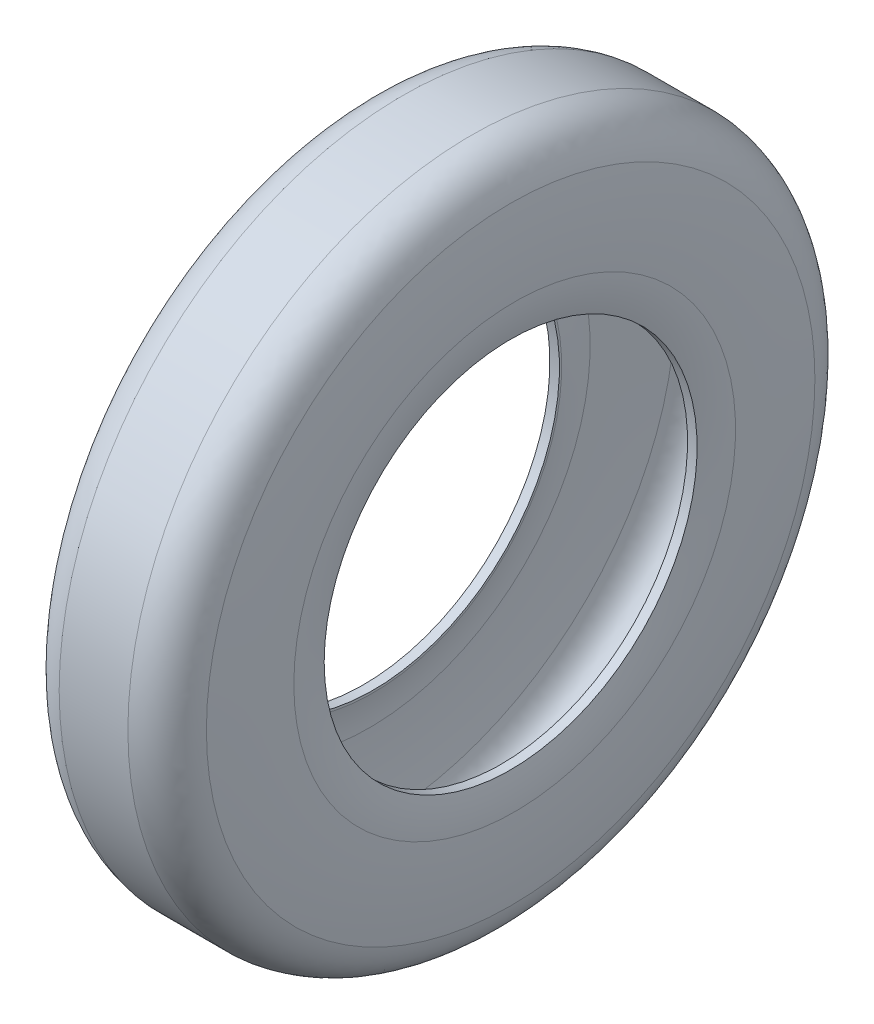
ISO-10303-21;
HEADER;
FILE_DESCRIPTION(('STEP AP214'),'2;1');
FILE_NAME('part.step','',(''),(''),'','','');
FILE_SCHEMA(('AUTOMOTIVE_DESIGN { 1 0 10303 214 1 1 1 1 }'));
ENDSEC;
DATA;
#1=APPLICATION_CONTEXT('core data for automotive mechanical design processes');
#2=APPLICATION_PROTOCOL_DEFINITION('international standard','automotive_design',2000,#1);
#3=PRODUCT_CONTEXT('',#1,'mechanical');
#4=PRODUCT('Part','Part','',(#3));
#5=PRODUCT_RELATED_PRODUCT_CATEGORY('part','',(#4));
#6=PRODUCT_DEFINITION_FORMATION('','',#4);
#7=PRODUCT_DEFINITION_CONTEXT('part definition',#1,'design');
#8=PRODUCT_DEFINITION('design','',#6,#7);
#9=PRODUCT_DEFINITION_SHAPE('','',#8);
#10=(LENGTH_UNIT() NAMED_UNIT(*) SI_UNIT(.MILLI.,.METRE.));
#11=(NAMED_UNIT(*) PLANE_ANGLE_UNIT() SI_UNIT($,.RADIAN.));
#12=(NAMED_UNIT(*) SI_UNIT($,.STERADIAN.) SOLID_ANGLE_UNIT());
#13=UNCERTAINTY_MEASURE_WITH_UNIT(LENGTH_MEASURE(1.E-05),#10,'distance_accuracy_value','');
#14=(GEOMETRIC_REPRESENTATION_CONTEXT(3) GLOBAL_UNCERTAINTY_ASSIGNED_CONTEXT((#13)) GLOBAL_UNIT_ASSIGNED_CONTEXT((#10,
#11,#12)) REPRESENTATION_CONTEXT('',''));
#15=CARTESIAN_POINT('',(0.,0.,0.));
#16=DIRECTION('',(0.,0.,1.));
#17=DIRECTION('',(1.,0.,0.));
#18=AXIS2_PLACEMENT_3D('',#15,#16,#17);
#19=CARTESIAN_POINT('',(-39.5580046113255,112.515379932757,0.));
#20=CARTESIAN_POINT('',(-39.553838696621,103.632489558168,0.));
#21=CARTESIAN_POINT('',(-37.5,95.,0.));
#22=B_SPLINE_CURVE_WITH_KNOTS('',2,(#19,#20,#21),.UNSPECIFIED.,.F.,.F.,(3,3),(0.,1.),.UNSPECIFIED.);
#23=CARTESIAN_POINT('',(-171.693896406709,0.,0.));
#24=DIRECTION('',(-1.,0.,0.));
#25=AXIS1_PLACEMENT('',#23,#24);
#26=SURFACE_OF_REVOLUTION('',#22,#25);
#27=CARTESIAN_POINT('',(-37.5,0.,0.));
#28=DIRECTION('',(-1.,0.,0.));
#29=DIRECTION('',(0.,0.,1.));
#30=AXIS2_PLACEMENT_3D('',#27,#28,#29);
#31=CIRCLE('',#30,95.);
#32=CARTESIAN_POINT('',(-37.5,0.,95.));
#33=VERTEX_POINT('',#32);
#34=EDGE_CURVE('E10',#33,#33,#31,.T.);
#35=ORIENTED_EDGE('',*,*,#34,.F.);
#36=EDGE_LOOP('',(#35));
#37=FACE_BOUND('',#36,.T.);
#38=CARTESIAN_POINT('',(-39.5580046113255,0.,0.));
#39=DIRECTION('',(-1.,0.,0.));
#40=DIRECTION('',(0.,0.,1.));
#41=AXIS2_PLACEMENT_3D('',#38,#39,#40);
#42=CIRCLE('',#41,112.515379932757);
#43=CARTESIAN_POINT('',(-39.5580046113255,0.,112.515379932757));
#44=VERTEX_POINT('',#43);
#45=EDGE_CURVE('E94',#44,#44,#42,.T.);
#46=ORIENTED_EDGE('',*,*,#45,.T.);
#47=EDGE_LOOP('',(#46));
#48=FACE_BOUND('',#47,.T.);
#49=ADVANCED_FACE('F35',(#37,#48),#26,.T.);
#50=CARTESIAN_POINT('',(-171.693896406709,0.,0.));
#51=DIRECTION('',(-1.,0.,0.));
#52=DIRECTION('',(0.,0.,1.));
#53=AXIS2_PLACEMENT_3D('',#50,#51,#52);
#54=CYLINDRICAL_SURFACE('',#53,95.);
#55=CARTESIAN_POINT('',(-32.635776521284,0.,0.));
#56=DIRECTION('',(-1.,0.,0.));
#57=DIRECTION('',(0.,0.,1.));
#58=AXIS2_PLACEMENT_3D('',#55,#56,#57);
#59=CIRCLE('',#58,95.);
#60=CARTESIAN_POINT('',(-32.635776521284,0.,95.));
#61=VERTEX_POINT('',#60);
#62=EDGE_CURVE('E42',#61,#61,#59,.T.);
#63=ORIENTED_EDGE('',*,*,#62,.F.);
#64=EDGE_LOOP('',(#63));
#65=FACE_BOUND('',#64,.T.);
#66=ORIENTED_EDGE('',*,*,#34,.T.);
#67=EDGE_LOOP('',(#66));
#68=FACE_BOUND('',#67,.T.);
#69=ADVANCED_FACE('F227',(#65,#68),#54,.F.);
#70=CARTESIAN_POINT('',(-32.635776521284,95.,0.));
#71=DIRECTION('',(-1.,0.,0.));
#72=DIRECTION('',(0.,0.,1.));
#73=AXIS2_PLACEMENT_3D('',#70,#71,#72);
#74=PLANE('',#73);
#75=CARTESIAN_POINT('',(-32.635776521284,0.,0.));
#76=DIRECTION('',(-1.,0.,0.));
#77=DIRECTION('',(0.,0.,1.));
#78=AXIS2_PLACEMENT_3D('',#75,#76,#77);
#79=CIRCLE('',#78,96.1572942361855);
#80=CARTESIAN_POINT('',(-32.635776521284,0.,96.1572942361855));
#81=VERTEX_POINT('',#80);
#82=EDGE_CURVE('E46',#81,#81,#79,.T.);
#83=ORIENTED_EDGE('',*,*,#82,.F.);
#84=EDGE_LOOP('',(#83));
#85=FACE_BOUND('',#84,.T.);
#86=ORIENTED_EDGE('',*,*,#62,.T.);
#87=EDGE_LOOP('',(#86));
#88=FACE_BOUND('',#87,.T.);
#89=ADVANCED_FACE('F212',(#85,#88),#74,.F.);
#90=CARTESIAN_POINT('',(-32.635776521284,96.1572942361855,0.));
#91=CARTESIAN_POINT('',(-34.5602061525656,104.242772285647,0.));
#92=CARTESIAN_POINT('',(-34.5580309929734,112.572805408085,0.));
#93=B_SPLINE_CURVE_WITH_KNOTS('',2,(#90,#91,#92),.UNSPECIFIED.,.F.,.F.,(3,3),(0.,
1.00310037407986),.UNSPECIFIED.);
#94=CARTESIAN_POINT('',(-171.693896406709,0.,0.));
#95=DIRECTION('',(-1.,0.,0.));
#96=AXIS1_PLACEMENT('',#94,#95);
#97=SURFACE_OF_REVOLUTION('',#93,#96);
#98=CARTESIAN_POINT('',(-34.5580309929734,0.,0.));
#99=DIRECTION('',(-1.,0.,0.));
#100=DIRECTION('',(0.,0.,1.));
#101=AXIS2_PLACEMENT_3D('',#98,#99,#100);
#102=CIRCLE('',#101,112.572805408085);
#103=CARTESIAN_POINT('',(-34.5580309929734,0.,112.572805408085));
#104=VERTEX_POINT('',#103);
#105=EDGE_CURVE('E50',#104,#104,#102,.T.);
#106=ORIENTED_EDGE('',*,*,#105,.F.);
#107=EDGE_LOOP('',(#106));
#108=FACE_BOUND('',#107,.T.);
#109=ORIENTED_EDGE('',*,*,#82,.T.);
#110=EDGE_LOOP('',(#109));
#111=FACE_BOUND('',#110,.T.);
#112=ADVANCED_FACE('F208',(#108,#111),#97,.T.);
#113=CARTESIAN_POINT('',(-34.5580309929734,112.572805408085,0.));
#114=CARTESIAN_POINT('',(-35.0305988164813,133.401140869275,0.));
#115=CARTESIAN_POINT('',(-32.5718831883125,154.100277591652,0.));
#116=B_SPLINE_CURVE_WITH_KNOTS('',2,(#113,#114,#115),.UNSPECIFIED.,.F.,.F.,(3,3),
(-0.00129214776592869,0.99268142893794),.UNSPECIFIED.);
#117=CARTESIAN_POINT('',(-171.693896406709,0.,0.));
#118=DIRECTION('',(-1.,0.,0.));
#119=AXIS1_PLACEMENT('',#117,#118);
#120=SURFACE_OF_REVOLUTION('',#116,#119);
#121=CARTESIAN_POINT('',(-32.5718831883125,0.,0.));
#122=DIRECTION('',(-1.,0.,0.));
#123=DIRECTION('',(0.,0.,1.));
#124=AXIS2_PLACEMENT_3D('',#121,#122,#123);
#125=CIRCLE('',#124,154.100277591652);
#126=CARTESIAN_POINT('',(-32.5718831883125,0.,154.100277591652));
#127=VERTEX_POINT('',#126);
#128=EDGE_CURVE('E55',#127,#127,#125,.T.);
#129=ORIENTED_EDGE('',*,*,#128,.F.);
#130=EDGE_LOOP('',(#129));
#131=FACE_BOUND('',#130,.T.);
#132=ORIENTED_EDGE('',*,*,#105,.T.);
#133=EDGE_LOOP('',(#132));
#134=FACE_BOUND('',#133,.T.);
#135=ADVANCED_FACE('F204',(#131,#134),#120,.T.);
#136=CARTESIAN_POINT('',(-32.5718831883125,154.100277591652,0.));
#137=CARTESIAN_POINT('',(-31.8471054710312,156.962883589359,0.));
#138=CARTESIAN_POINT('',(-29.8373746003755,161.506356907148,0.));
#139=CARTESIAN_POINT('',(-26.9425016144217,165.499652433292,0.));
#140=CARTESIAN_POINT('',(-23.3006905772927,168.104519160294,0.));
#141=CARTESIAN_POINT('',(-19.4742597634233,169.620198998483,0.));
#142=CARTESIAN_POINT('',(-17.124055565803,170.,0.));
#143=B_SPLINE_CURVE_WITH_KNOTS('',2,(#136,#137,#138,#139,#140,#141,#142),.UNSPECIFIED.,.F.,.F.,
(3,1,1,1,1,3),(0.00902413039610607,0.192379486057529,0.375734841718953,0.620208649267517,
0.80356400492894,0.986919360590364),.UNSPECIFIED.);
#144=CARTESIAN_POINT('',(-171.693896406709,0.,0.));
#145=DIRECTION('',(-1.,0.,0.));
#146=AXIS1_PLACEMENT('',#144,#145);
#147=SURFACE_OF_REVOLUTION('',#143,#146);
#148=CARTESIAN_POINT('',(-17.124055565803,0.,0.));
#149=DIRECTION('',(-1.,0.,0.));
#150=DIRECTION('',(0.,0.,1.));
#151=AXIS2_PLACEMENT_3D('',#148,#149,#150);
#152=CIRCLE('',#151,170.);
#153=CARTESIAN_POINT('',(-17.124055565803,0.,170.));
#154=VERTEX_POINT('',#153);
#155=EDGE_CURVE('E58',#154,#154,#152,.T.);
#156=ORIENTED_EDGE('',*,*,#155,.F.);
#157=EDGE_LOOP('',(#156));
#158=FACE_BOUND('',#157,.T.);
#159=ORIENTED_EDGE('',*,*,#128,.T.);
#160=EDGE_LOOP('',(#159));
#161=FACE_BOUND('',#160,.T.);
#162=ADVANCED_FACE('F200',(#158,#161),#147,.T.);
#163=CARTESIAN_POINT('',(-171.693896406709,0.,0.));
#164=DIRECTION('',(-1.,0.,0.));
#165=DIRECTION('',(0.,0.,1.));
#166=AXIS2_PLACEMENT_3D('',#163,#164,#165);
#167=CYLINDRICAL_SURFACE('',#166,170.);
#168=CARTESIAN_POINT('',(17.1240555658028,0.,0.));
#169=DIRECTION('',(-1.,0.,0.));
#170=DIRECTION('',(0.,0.,1.));
#171=AXIS2_PLACEMENT_3D('',#168,#169,#170);
#172=CIRCLE('',#171,170.);
#173=CARTESIAN_POINT('',(17.1240555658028,0.,170.));
#174=VERTEX_POINT('',#173);
#175=EDGE_CURVE('E61',#174,#174,#172,.T.);
#176=ORIENTED_EDGE('',*,*,#175,.F.);
#177=EDGE_LOOP('',(#176));
#178=FACE_BOUND('',#177,.T.);
#179=ORIENTED_EDGE('',*,*,#155,.T.);
#180=EDGE_LOOP('',(#179));
#181=FACE_BOUND('',#180,.T.);
#182=ADVANCED_FACE('F203',(#178,#181),#167,.F.);
#183=CARTESIAN_POINT('',(17.1240555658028,170.,0.));
#184=CARTESIAN_POINT('',(19.4742597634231,169.620198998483,0.));
#185=CARTESIAN_POINT('',(23.3006905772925,168.104519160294,0.));
#186=CARTESIAN_POINT('',(26.9425016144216,165.499652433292,0.));
#187=CARTESIAN_POINT('',(29.8373746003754,161.506356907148,0.));
#188=CARTESIAN_POINT('',(31.8471054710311,156.962883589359,0.));
#189=CARTESIAN_POINT('',(32.5718831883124,154.100277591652,0.));
#190=B_SPLINE_CURVE_WITH_KNOTS('',2,(#183,#184,#185,#186,#187,#188,#189),.UNSPECIFIED.,.F.,.F.,
(3,1,1,1,1,3),(0.00902413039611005,0.192379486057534,0.375734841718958,0.620208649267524,
0.803564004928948,0.986919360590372),.UNSPECIFIED.);
#191=CARTESIAN_POINT('',(-171.693896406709,0.,0.));
#192=DIRECTION('',(-1.,0.,0.));
#193=AXIS1_PLACEMENT('',#191,#192);
#194=SURFACE_OF_REVOLUTION('',#190,#193);
#195=CARTESIAN_POINT('',(32.5718831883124,0.,0.));
#196=DIRECTION('',(-1.,0.,0.));
#197=DIRECTION('',(0.,0.,1.));
#198=AXIS2_PLACEMENT_3D('',#195,#196,#197);
#199=CIRCLE('',#198,154.100277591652);
#200=CARTESIAN_POINT('',(32.5718831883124,0.,154.100277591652));
#201=VERTEX_POINT('',#200);
#202=EDGE_CURVE('E64',#201,#201,#199,.T.);
#203=ORIENTED_EDGE('',*,*,#202,.F.);
#204=EDGE_LOOP('',(#203));
#205=FACE_BOUND('',#204,.T.);
#206=ORIENTED_EDGE('',*,*,#175,.T.);
#207=EDGE_LOOP('',(#206));
#208=FACE_BOUND('',#207,.T.);
#209=ADVANCED_FACE('F171',(#205,#208),#194,.T.);
#210=CARTESIAN_POINT('',(32.5718831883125,154.100277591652,0.));
#211=CARTESIAN_POINT('',(35.0305988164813,133.401140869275,0.));
#212=CARTESIAN_POINT('',(34.5580309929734,112.572805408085,0.));
#213=B_SPLINE_CURVE_WITH_KNOTS('',2,(#210,#211,#212),.UNSPECIFIED.,.F.,.F.,(3,3),
(-0.00129214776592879,0.992681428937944),.UNSPECIFIED.);
#214=CARTESIAN_POINT('',(-171.693896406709,0.,0.));
#215=DIRECTION('',(-1.,0.,0.));
#216=AXIS1_PLACEMENT('',#214,#215);
#217=SURFACE_OF_REVOLUTION('',#213,#216);
#218=CARTESIAN_POINT('',(34.5580309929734,0.,0.));
#219=DIRECTION('',(-1.,0.,0.));
#220=DIRECTION('',(0.,0.,1.));
#221=AXIS2_PLACEMENT_3D('',#218,#219,#220);
#222=CIRCLE('',#221,112.572805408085);
#223=CARTESIAN_POINT('',(34.5580309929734,0.,112.572805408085));
#224=VERTEX_POINT('',#223);
#225=EDGE_CURVE('E67',#224,#224,#222,.T.);
#226=ORIENTED_EDGE('',*,*,#225,.F.);
#227=EDGE_LOOP('',(#226));
#228=FACE_BOUND('',#227,.T.);
#229=ORIENTED_EDGE('',*,*,#202,.T.);
#230=EDGE_LOOP('',(#229));
#231=FACE_BOUND('',#230,.T.);
#232=ADVANCED_FACE('F167',(#228,#231),#217,.T.);
#233=CARTESIAN_POINT('',(34.5580309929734,112.572805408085,0.));
#234=CARTESIAN_POINT('',(34.5602061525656,104.242772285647,0.));
#235=CARTESIAN_POINT('',(32.635776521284,96.1572942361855,0.));
#236=B_SPLINE_CURVE_WITH_KNOTS('',2,(#233,#234,#235),.UNSPECIFIED.,.F.,.F.,(3,3),(0.,
1.00310037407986),.UNSPECIFIED.);
#237=CARTESIAN_POINT('',(-171.693896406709,0.,0.));
#238=DIRECTION('',(-1.,0.,0.));
#239=AXIS1_PLACEMENT('',#237,#238);
#240=SURFACE_OF_REVOLUTION('',#236,#239);
#241=CARTESIAN_POINT('',(32.635776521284,0.,0.));
#242=DIRECTION('',(-1.,0.,0.));
#243=DIRECTION('',(0.,0.,1.));
#244=AXIS2_PLACEMENT_3D('',#241,#242,#243);
#245=CIRCLE('',#244,96.1572942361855);
#246=CARTESIAN_POINT('',(32.635776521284,0.,96.1572942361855));
#247=VERTEX_POINT('',#246);
#248=EDGE_CURVE('E70',#247,#247,#245,.T.);
#249=ORIENTED_EDGE('',*,*,#248,.F.);
#250=EDGE_LOOP('',(#249));
#251=FACE_BOUND('',#250,.T.);
#252=ORIENTED_EDGE('',*,*,#225,.T.);
#253=EDGE_LOOP('',(#252));
#254=FACE_BOUND('',#253,.T.);
#255=ADVANCED_FACE('F163',(#251,#254),#240,.T.);
#256=CARTESIAN_POINT('',(32.635776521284,95.0000000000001,0.));
#257=DIRECTION('',(1.,0.,0.));
#258=DIRECTION('',(0.,0.,-1.));
#259=AXIS2_PLACEMENT_3D('',#256,#257,#258);
#260=PLANE('',#259);
#261=CARTESIAN_POINT('',(32.635776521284,0.,0.));
#262=DIRECTION('',(-1.,0.,0.));
#263=DIRECTION('',(0.,0.,1.));
#264=AXIS2_PLACEMENT_3D('',#261,#262,#263);
#265=CIRCLE('',#264,95.0000000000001);
#266=CARTESIAN_POINT('',(32.635776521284,0.,95.0000000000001));
#267=VERTEX_POINT('',#266);
#268=EDGE_CURVE('E73',#267,#267,#265,.T.);
#269=ORIENTED_EDGE('',*,*,#268,.F.);
#270=EDGE_LOOP('',(#269));
#271=FACE_BOUND('',#270,.T.);
#272=ORIENTED_EDGE('',*,*,#248,.T.);
#273=EDGE_LOOP('',(#272));
#274=FACE_BOUND('',#273,.T.);
#275=ADVANCED_FACE('F159',(#271,#274),#260,.F.);
#276=CARTESIAN_POINT('',(-171.693896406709,0.,0.));
#277=DIRECTION('',(-1.,0.,0.));
#278=DIRECTION('',(0.,0.,1.));
#279=AXIS2_PLACEMENT_3D('',#276,#277,#278);
#280=CYLINDRICAL_SURFACE('',#279,95.0000000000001);
#281=CARTESIAN_POINT('',(37.5,0.,0.));
#282=DIRECTION('',(-1.,0.,0.));
#283=DIRECTION('',(0.,0.,1.));
#284=AXIS2_PLACEMENT_3D('',#281,#282,#283);
#285=CIRCLE('',#284,95.0000000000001);
#286=CARTESIAN_POINT('',(37.5,0.,95.0000000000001));
#287=VERTEX_POINT('',#286);
#288=EDGE_CURVE('E76',#287,#287,#285,.T.);
#289=ORIENTED_EDGE('',*,*,#288,.F.);
#290=EDGE_LOOP('',(#289));
#291=FACE_BOUND('',#290,.T.);
#292=ORIENTED_EDGE('',*,*,#268,.T.);
#293=EDGE_LOOP('',(#292));
#294=FACE_BOUND('',#293,.T.);
#295=ADVANCED_FACE('F155',(#291,#294),#280,.F.);
#296=CARTESIAN_POINT('',(37.5,95.,0.));
#297=CARTESIAN_POINT('',(39.553838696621,103.632489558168,0.));
#298=CARTESIAN_POINT('',(39.5580046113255,112.515379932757,0.));
#299=B_SPLINE_CURVE_WITH_KNOTS('',2,(#296,#297,#298),.UNSPECIFIED.,.F.,.F.,(3,3),(0.,1.),.UNSPECIFIED.);
#300=CARTESIAN_POINT('',(-171.693896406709,0.,0.));
#301=DIRECTION('',(-1.,0.,0.));
#302=AXIS1_PLACEMENT('',#300,#301);
#303=SURFACE_OF_REVOLUTION('',#299,#302);
#304=CARTESIAN_POINT('',(39.5580046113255,0.,0.));
#305=DIRECTION('',(-1.,0.,0.));
#306=DIRECTION('',(0.,0.,1.));
#307=AXIS2_PLACEMENT_3D('',#304,#305,#306);
#308=CIRCLE('',#307,112.515379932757);
#309=CARTESIAN_POINT('',(39.5580046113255,0.,112.515379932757));
#310=VERTEX_POINT('',#309);
#311=EDGE_CURVE('E79',#310,#310,#308,.T.);
#312=ORIENTED_EDGE('',*,*,#311,.F.);
#313=EDGE_LOOP('',(#312));
#314=FACE_BOUND('',#313,.T.);
#315=ORIENTED_EDGE('',*,*,#288,.T.);
#316=EDGE_LOOP('',(#315));
#317=FACE_BOUND('',#316,.T.);
#318=ADVANCED_FACE('F152',(#314,#317),#303,.T.);
#319=CARTESIAN_POINT('',(39.5580046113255,112.515379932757,0.));
#320=CARTESIAN_POINT('',(40.037526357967,133.823558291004,0.));
#321=CARTESIAN_POINT('',(37.5,155.,0.));
#322=B_SPLINE_CURVE_WITH_KNOTS('',2,(#319,#320,#321),.UNSPECIFIED.,.F.,.F.,(3,3),(0.,1.),.UNSPECIFIED.);
#323=CARTESIAN_POINT('',(-171.693896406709,0.,0.));
#324=DIRECTION('',(-1.,0.,0.));
#325=AXIS1_PLACEMENT('',#323,#324);
#326=SURFACE_OF_REVOLUTION('',#322,#325);
#327=CARTESIAN_POINT('',(37.5,0.,0.));
#328=DIRECTION('',(-1.,0.,0.));
#329=DIRECTION('',(0.,0.,1.));
#330=AXIS2_PLACEMENT_3D('',#327,#328,#329);
#331=CIRCLE('',#330,155.);
#332=CARTESIAN_POINT('',(37.5,0.,155.));
#333=VERTEX_POINT('',#332);
#334=EDGE_CURVE('E82',#333,#333,#331,.T.);
#335=ORIENTED_EDGE('',*,*,#334,.F.);
#336=EDGE_LOOP('',(#335));
#337=FACE_BOUND('',#336,.T.);
#338=ORIENTED_EDGE('',*,*,#311,.T.);
#339=EDGE_LOOP('',(#338));
#340=FACE_BOUND('',#339,.T.);
#341=ADVANCED_FACE('F124',(#337,#340),#326,.T.);
#342=CARTESIAN_POINT('',(37.5,155.,0.));
#343=CARTESIAN_POINT('',(33.1808310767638,172.735676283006,0.));
#344=CARTESIAN_POINT('',(17.4999999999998,175.,0.));
#345=B_SPLINE_CURVE_WITH_KNOTS('',2,(#342,#343,#344),.UNSPECIFIED.,.F.,.F.,(3,3),(0.,1.),.UNSPECIFIED.);
#346=CARTESIAN_POINT('',(-171.693896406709,0.,0.));
#347=DIRECTION('',(-1.,0.,0.));
#348=AXIS1_PLACEMENT('',#346,#347);
#349=SURFACE_OF_REVOLUTION('',#345,#348);
#350=CARTESIAN_POINT('',(17.4999999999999,0.,0.));
#351=DIRECTION('',(-1.,0.,0.));
#352=DIRECTION('',(0.,0.,1.));
#353=AXIS2_PLACEMENT_3D('',#350,#351,#352);
#354=CIRCLE('',#353,175.);
#355=CARTESIAN_POINT('',(17.4999999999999,0.,175.));
#356=VERTEX_POINT('',#355);
#357=EDGE_CURVE('E85',#356,#356,#354,.T.);
#358=ORIENTED_EDGE('',*,*,#357,.F.);
#359=EDGE_LOOP('',(#358));
#360=FACE_BOUND('',#359,.T.);
#361=ORIENTED_EDGE('',*,*,#334,.T.);
#362=EDGE_LOOP('',(#361));
#363=FACE_BOUND('',#362,.T.);
#364=ADVANCED_FACE('F120',(#360,#363),#349,.T.);
#365=CARTESIAN_POINT('',(-171.693896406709,0.,0.));
#366=DIRECTION('',(-1.,0.,0.));
#367=DIRECTION('',(0.,0.,1.));
#368=AXIS2_PLACEMENT_3D('',#365,#366,#367);
#369=CYLINDRICAL_SURFACE('',#368,175.);
#370=CARTESIAN_POINT('',(-17.4999999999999,0.,0.));
#371=DIRECTION('',(-1.,0.,0.));
#372=DIRECTION('',(0.,0.,1.));
#373=AXIS2_PLACEMENT_3D('',#370,#371,#372);
#374=CIRCLE('',#373,175.);
#375=CARTESIAN_POINT('',(-17.4999999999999,0.,175.));
#376=VERTEX_POINT('',#375);
#377=EDGE_CURVE('E88',#376,#376,#374,.T.);
#378=ORIENTED_EDGE('',*,*,#377,.F.);
#379=EDGE_LOOP('',(#378));
#380=FACE_BOUND('',#379,.T.);
#381=ORIENTED_EDGE('',*,*,#357,.T.);
#382=EDGE_LOOP('',(#381));
#383=FACE_BOUND('',#382,.T.);
#384=ADVANCED_FACE('F116',(#380,#383),#369,.T.);
#385=CARTESIAN_POINT('',(-17.4999999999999,175.,0.));
#386=CARTESIAN_POINT('',(-33.1808310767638,172.735676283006,0.));
#387=CARTESIAN_POINT('',(-37.5,155.,0.));
#388=B_SPLINE_CURVE_WITH_KNOTS('',2,(#385,#386,#387),.UNSPECIFIED.,.F.,.F.,(3,3),(0.,1.),.UNSPECIFIED.);
#389=CARTESIAN_POINT('',(-171.693896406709,0.,0.));
#390=DIRECTION('',(-1.,0.,0.));
#391=AXIS1_PLACEMENT('',#389,#390);
#392=SURFACE_OF_REVOLUTION('',#388,#391);
#393=CARTESIAN_POINT('',(-37.5,0.,0.));
#394=DIRECTION('',(-1.,0.,0.));
#395=DIRECTION('',(0.,0.,1.));
#396=AXIS2_PLACEMENT_3D('',#393,#394,#395);
#397=CIRCLE('',#396,155.);
#398=CARTESIAN_POINT('',(-37.5,0.,155.));
#399=VERTEX_POINT('',#398);
#400=EDGE_CURVE('E91',#399,#399,#397,.T.);
#401=ORIENTED_EDGE('',*,*,#400,.F.);
#402=EDGE_LOOP('',(#401));
#403=FACE_BOUND('',#402,.T.);
#404=ORIENTED_EDGE('',*,*,#377,.T.);
#405=EDGE_LOOP('',(#404));
#406=FACE_BOUND('',#405,.T.);
#407=ADVANCED_FACE('F112',(#403,#406),#392,.T.);
#408=CARTESIAN_POINT('',(-37.5,155.,0.));
#409=CARTESIAN_POINT('',(-40.037526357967,133.823558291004,0.));
#410=CARTESIAN_POINT('',(-39.5580046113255,112.515379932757,0.));
#411=B_SPLINE_CURVE_WITH_KNOTS('',2,(#408,#409,#410),.UNSPECIFIED.,.F.,.F.,(3,3),(0.,1.),.UNSPECIFIED.);
#412=CARTESIAN_POINT('',(-171.693896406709,0.,0.));
#413=DIRECTION('',(-1.,0.,0.));
#414=AXIS1_PLACEMENT('',#412,#413);
#415=SURFACE_OF_REVOLUTION('',#411,#414);
#416=ORIENTED_EDGE('',*,*,#45,.F.);
#417=EDGE_LOOP('',(#416));
#418=FACE_BOUND('',#417,.T.);
#419=ORIENTED_EDGE('',*,*,#400,.T.);
#420=EDGE_LOOP('',(#419));
#421=FACE_BOUND('',#420,.T.);
#422=ADVANCED_FACE('F109',(#418,#421),#415,.T.);
#423=CLOSED_SHELL('',(#49,#69,#89,#112,#135,#162,#182,#209,#232,#255,#275,#295,#318,#341,#364,
#384,#407,#422));
#424=MANIFOLD_SOLID_BREP('B2',#423);
#425=ADVANCED_BREP_SHAPE_REPRESENTATION('',(#18,#424),#14);
#426=SHAPE_DEFINITION_REPRESENTATION(#9,#425);
ENDSEC;
END-ISO-10303-21;
